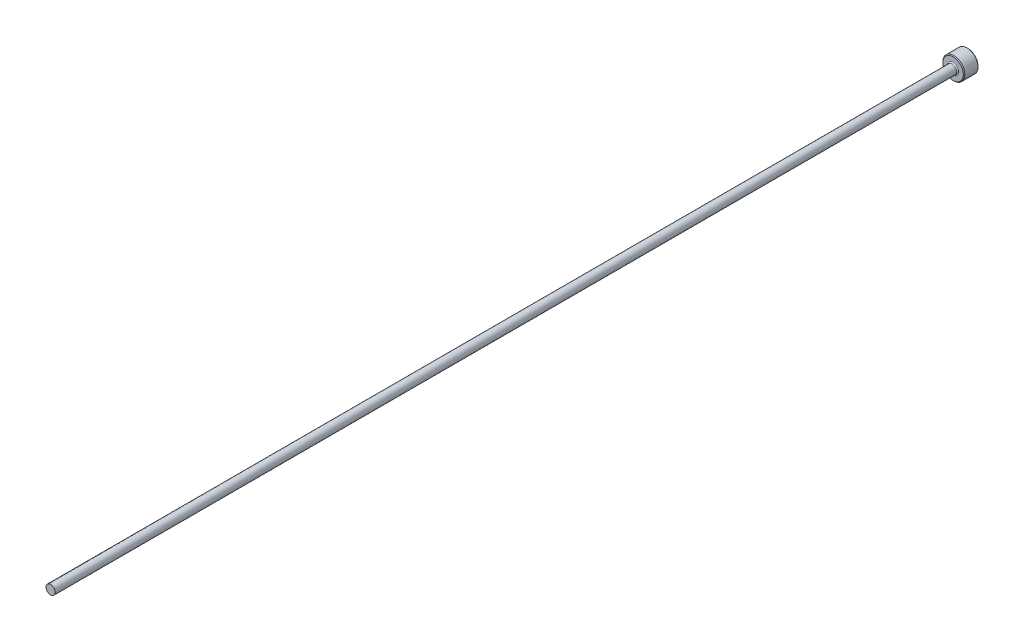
from build123d import *

# Parameters (mm, degrees)
CHAMFER1_SIZE = 0.2


with BuildPart() as part:
    # Sketch1 → Revolve1 (revolve)
    with BuildSketch(Plane(origin=(0, 0, 0), x_dir=(0, 0, -1), z_dir=(1, 0, 0)), mode=Mode.PRIVATE) as revolve1_sk:
        with BuildLine():
            Line((0, 0), (0, 3))
            Line((0, 3), (-4, 3))
            Line((-4, 3), (-4, 1.55))
            ThreePointArc((-4, 1.55), (-4.087867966, 1.337867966), (-4.3, 1.25))
            Line((-4.3, 1.25), (-250, 1.25))
            Line((-250, 1.25), (-250, 0))
            Line((-250, 0), (0, 0))
        make_face()
    revolve(revolve1_sk.sketch.rotate(Axis((0, 0, 109.05062828), (0, 0, -1)), 90), axis=Axis((0, 0, 109.05062828), (0, 0, -1)))

    # Chamfer1
    chamfer1_edges = [part.edges().sort_by_distance(p)[0] for p in [
        (-3, 0, 0),
        (-3, 0, 4),
    ]]
    chamfer(chamfer1_edges, length=CHAMFER1_SIZE)


solid = part.part
